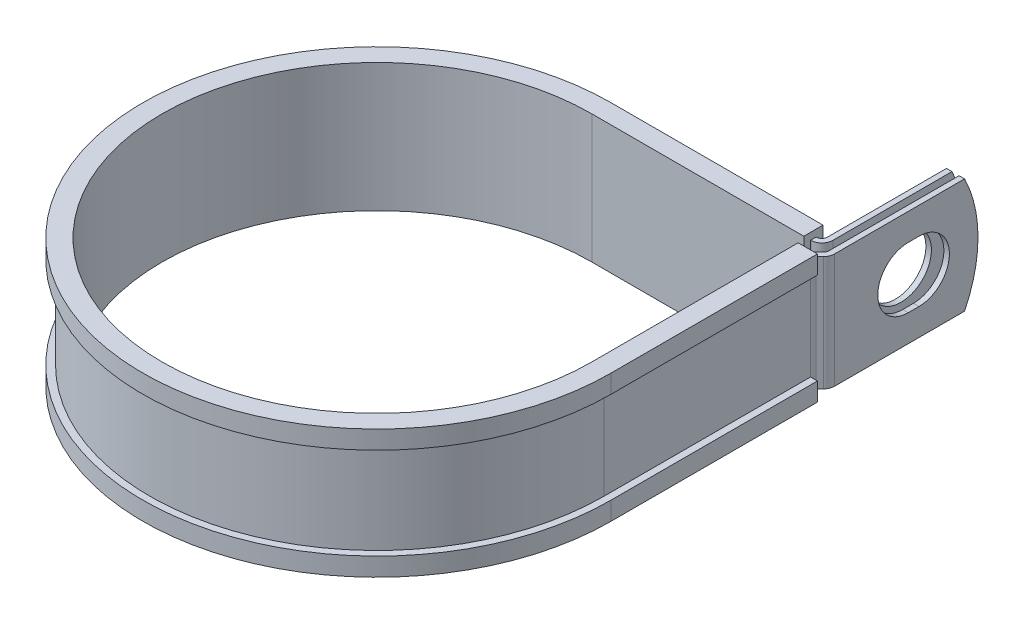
from build123d import *

# Parameters (mm, degrees)
EXTRUDE_THIN1_DEPTH = 12.7
SKETCH2_R           = 6.7437
CUT_EXTRUDE1_DEPTH  = 1.2192
CUT_EXTRUDE2_DEPTH  = 1.2192
CUT_EXTRUDE3_DEPTH  = 129.21933018


with BuildPart() as part:
    # Sketch1 → Extrude-Thin1 (new, symmetric)
    with BuildSketch(Plane(origin=(0, 0, 0), x_dir=(1, 0, 0), z_dir=(0, 1, 0))):
        with BuildLine():
            Line((51.0464698, 80.9498), (51.0464698, 49.149))
            ThreePointArc((51.0464698, 49.149), (50.953663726, 48.682432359), (50.689374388, 48.286895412))
            Line((50.689374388, 48.286895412), (49.863190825, 47.460711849))
            ThreePointArc((49.863190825, 47.460711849), (49.334612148, 46.669637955), (49.149, 45.736502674))
            Line((49.149, 45.736502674), (49.149, 0))
            ThreePointArc((49.149, 0), (-34.753591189, -34.753591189), (0, 49.149))
            Line((0, 49.149), (47.0332698, 49.149))
            ThreePointArc((47.0332698, 49.149), (48.757478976, 49.863190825), (49.4716698, 51.5874))
            Line((49.4716698, 51.5874), (49.4716698, 80.9498))
            Line((49.4716698, 80.9498), (48.2524698, 80.9498))
            Line((48.2524698, 80.9498), (48.2524698, 51.5874))
            ThreePointArc((48.2524698, 51.5874), (47.895374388, 50.725295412), (47.0332698, 50.3682))
            Line((47.0332698, 50.3682), (0, 50.3682))
            ThreePointArc((0, 50.3682), (-35.615695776, -35.615695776), (50.3682, 0))
            Line((50.3682, 0), (50.3682, 45.736502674))
            ThreePointArc((50.3682, 45.736502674), (50.461006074, 46.203070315), (50.725295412, 46.598607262))
            Line((50.725295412, 46.598607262), (51.551478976, 47.424790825))
            ThreePointArc((51.551478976, 47.424790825), (52.080057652, 48.215864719), (52.2656698, 49.149))
            Line((52.2656698, 49.149), (52.2656698, 80.9498))
            Line((52.2656698, 80.9498), (51.0464698, 80.9498))
        make_face()
    extrude(amount=EXTRUDE_THIN1_DEPTH, both=True)

    # Sketch2 → Cut-Extrude1 (cut)
    with BuildSketch(Plane.ZY.offset(-48.2524698)):
        with Locations((-66.675, 0)):
            Circle(SKETCH2_R)
    extrude(amount=-CUT_EXTRUDE1_DEPTH, mode=Mode.SUBTRACT)

    # Sketch3 → Cut-Extrude2 (cut)
    with BuildSketch(Plane(origin=(52.2656698, 0, 0), x_dir=(0, 0, -1), z_dir=(1, 0, 0))):
        with BuildLine():
            Line((65.4812, 6.7437), (67.8688, 6.7437))
            ThreePointArc((67.8688, 6.7437), (74.6125, 0), (67.8688, -6.7437))
            Line((67.8688, -6.7437), (65.4812, -6.7437))
            ThreePointArc((65.4812, -6.7437), (58.7375, 0), (65.4812, 6.7437))
        make_face()
    extrude(amount=-CUT_EXTRUDE2_DEPTH, mode=Mode.SUBTRACT)

    # Sketch4 → Cut-Extrude3 (cut, through all)
    with BuildSketch(Plane.ZY.offset(-48.2524698)):
        with BuildLine():
            Line((-77.972468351, 12.7), (-80.9498, 12.7))
            Line((-80.9498, 12.7), (-80.9498, 0))
            ThreePointArc((-80.9498, 0), (-80.195511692, 6.522164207), (-77.972468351, 12.7))
        make_face()
        with BuildLine():
            ThreePointArc((-77.972468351, -12.7), (-80.195511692, -6.522164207), (-80.9498, 0))
            Line((-80.9498, 0), (-80.9498, -12.7))
            Line((-80.9498, -12.7), (-77.972468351, -12.7))
        make_face()
    extrude(amount=-CUT_EXTRUDE3_DEPTH, mode=Mode.SUBTRACT)

    # Sweep1: sweep along a path in Sketch6
    with BuildLine(Plane(origin=(0, 12.7, 0), x_dir=(1, 0, 0), z_dir=(0, 1, 0))) as sweep1_path:
        Line((47.625, 45.736502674), (47.625, 0))
        ThreePointArc((47.625, 0), (-33.675960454, -33.675960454), (0, 47.625))
        Line((0, 47.625), (46.9824698, 47.625))
    # Sketch5 → Sweep1 (sweep)
    with BuildSketch(Plane(origin=(0, 0, -45.736502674), x_dir=(-1, 0, 0), z_dir=(0, 0, -1))):
        Polygon((-50.3682, 12.7), (-49.149, 12.7), (-49.149, -12.7), (-50.3682, -12.7), (-50.3682, -10.16), (-51.8922, -10.16), (-51.8922, -14.224), (-47.625, -14.224), (-47.625, 14.224), (-51.8922, 14.224), (-51.8922, 10.16), (-50.3682, 10.16), align=None)
    sweep(path=sweep1_path.line)


solid = part.part
